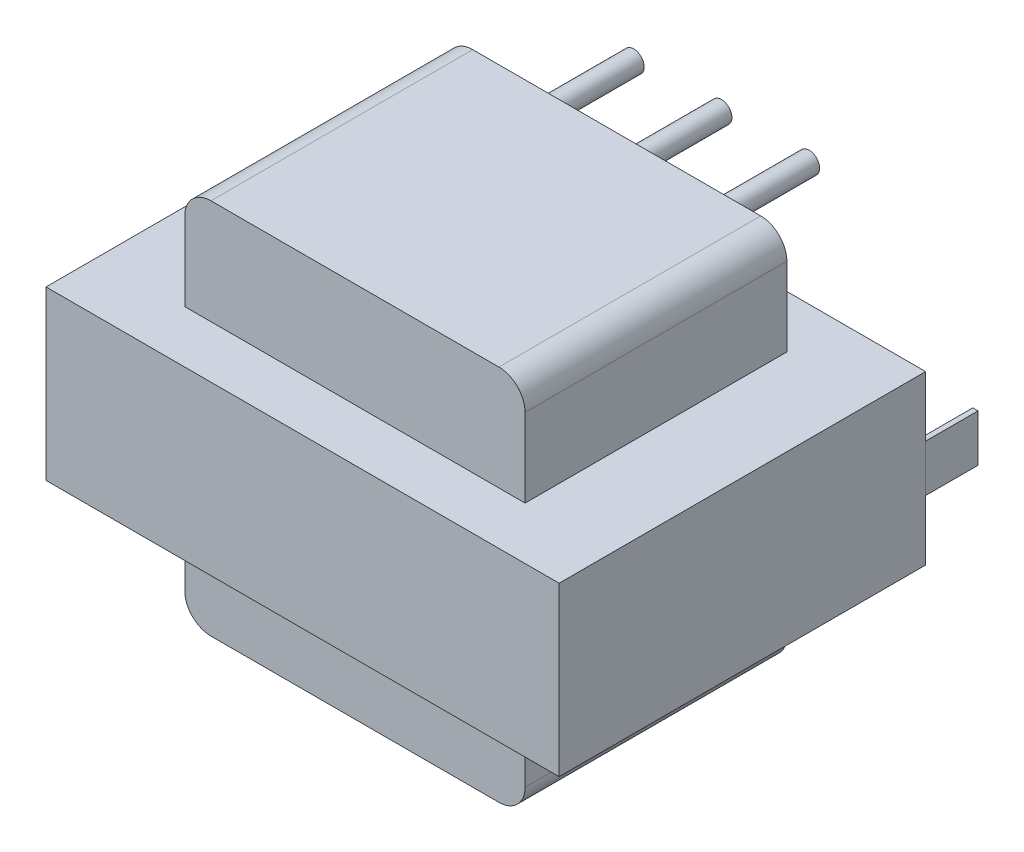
ISO-10303-21;
HEADER;
FILE_DESCRIPTION(('STEP AP214'),'2;1');
FILE_NAME('part.step','',(''),(''),'','','');
FILE_SCHEMA(('AUTOMOTIVE_DESIGN { 1 0 10303 214 1 1 1 1 }'));
ENDSEC;
DATA;
#1=APPLICATION_CONTEXT('core data for automotive mechanical design processes');
#2=APPLICATION_PROTOCOL_DEFINITION('international standard','automotive_design',2000,#1);
#3=PRODUCT_CONTEXT('',#1,'mechanical');
#4=PRODUCT('Part','Part','',(#3));
#5=PRODUCT_RELATED_PRODUCT_CATEGORY('part','',(#4));
#6=PRODUCT_DEFINITION_FORMATION('','',#4);
#7=PRODUCT_DEFINITION_CONTEXT('part definition',#1,'design');
#8=PRODUCT_DEFINITION('design','',#6,#7);
#9=PRODUCT_DEFINITION_SHAPE('','',#8);
#10=(LENGTH_UNIT() NAMED_UNIT(*) SI_UNIT(.MILLI.,.METRE.));
#11=(NAMED_UNIT(*) PLANE_ANGLE_UNIT() SI_UNIT($,.RADIAN.));
#12=(NAMED_UNIT(*) SI_UNIT($,.STERADIAN.) SOLID_ANGLE_UNIT());
#13=UNCERTAINTY_MEASURE_WITH_UNIT(LENGTH_MEASURE(1.E-05),#10,'distance_accuracy_value','');
#14=(GEOMETRIC_REPRESENTATION_CONTEXT(3) GLOBAL_UNCERTAINTY_ASSIGNED_CONTEXT((#13)) GLOBAL_UNIT_ASSIGNED_CONTEXT((#10,
#11,#12)) REPRESENTATION_CONTEXT('',''));
#15=CARTESIAN_POINT('',(0.,0.,0.));
#16=DIRECTION('',(0.,0.,1.));
#17=DIRECTION('',(1.,0.,0.));
#18=AXIS2_PLACEMENT_3D('',#15,#16,#17);
#19=CARTESIAN_POINT('',(12.446,-1.143,-5.08));
#20=DIRECTION('',(-1.,0.,0.));
#21=DIRECTION('',(0.,0.,1.));
#22=AXIS2_PLACEMENT_3D('',#19,#20,#21);
#23=PLANE('',#22);
#24=DIRECTION('',(0.,-1.,0.));
#25=VECTOR('',#24,1.);
#26=CARTESIAN_POINT('',(12.446,-1.143,-2.54));
#27=LINE('',#26,#25);
#28=CARTESIAN_POINT('',(12.446,1.143,-2.54));
#29=VERTEX_POINT('',#28);
#30=CARTESIAN_POINT('',(12.446,-1.143,-2.54));
#31=VERTEX_POINT('',#30);
#32=EDGE_CURVE('E107',#29,#31,#27,.T.);
#33=ORIENTED_EDGE('',*,*,#32,.T.);
#34=DIRECTION('',(0.,0.,1.));
#35=VECTOR('',#34,1.);
#36=CARTESIAN_POINT('',(12.446,-1.143,-5.08));
#37=LINE('',#36,#35);
#38=CARTESIAN_POINT('',(12.446,-1.143,-5.08));
#39=VERTEX_POINT('',#38);
#40=EDGE_CURVE('E12',#39,#31,#37,.T.);
#41=ORIENTED_EDGE('',*,*,#40,.F.);
#42=DIRECTION('',(0.,-1.,0.));
#43=VECTOR('',#42,1.);
#44=CARTESIAN_POINT('',(12.446,-1.143,-5.08));
#45=LINE('',#44,#43);
#46=CARTESIAN_POINT('',(12.446,1.143,-5.08));
#47=VERTEX_POINT('',#46);
#48=EDGE_CURVE('E95',#47,#39,#45,.T.);
#49=ORIENTED_EDGE('',*,*,#48,.F.);
#50=DIRECTION('',(0.,0.,1.));
#51=VECTOR('',#50,1.);
#52=CARTESIAN_POINT('',(12.446,1.143,-5.08));
#53=LINE('',#52,#51);
#54=EDGE_CURVE('E103',#47,#29,#53,.T.);
#55=ORIENTED_EDGE('',*,*,#54,.T.);
#56=EDGE_LOOP('',(#33,#41,#49,#55));
#57=FACE_BOUND('',#56,.T.);
#58=ADVANCED_FACE('F44',(#57),#23,.F.);
#59=CARTESIAN_POINT('',(12.446,-1.143,-5.08));
#60=DIRECTION('',(0.,1.,0.));
#61=DIRECTION('',(0.,0.,1.));
#62=AXIS2_PLACEMENT_3D('',#59,#60,#61);
#63=PLANE('',#62);
#64=DIRECTION('',(-1.,0.,0.));
#65=VECTOR('',#64,1.);
#66=CARTESIAN_POINT('',(12.446,-1.143,-2.54));
#67=LINE('',#66,#65);
#68=CARTESIAN_POINT('',(12.192,-1.143,-2.54));
#69=VERTEX_POINT('',#68);
#70=EDGE_CURVE('E99',#31,#69,#67,.T.);
#71=ORIENTED_EDGE('',*,*,#70,.T.);
#72=DIRECTION('',(0.,0.,1.));
#73=VECTOR('',#72,1.);
#74=CARTESIAN_POINT('',(12.192,-1.143,-5.08));
#75=LINE('',#74,#73);
#76=CARTESIAN_POINT('',(12.192,-1.143,-5.08));
#77=VERTEX_POINT('',#76);
#78=EDGE_CURVE('E52',#77,#69,#75,.T.);
#79=ORIENTED_EDGE('',*,*,#78,.F.);
#80=DIRECTION('',(-1.,0.,0.));
#81=VECTOR('',#80,1.);
#82=CARTESIAN_POINT('',(12.446,-1.143,-5.08));
#83=LINE('',#82,#81);
#84=EDGE_CURVE('E90',#39,#77,#83,.T.);
#85=ORIENTED_EDGE('',*,*,#84,.F.);
#86=ORIENTED_EDGE('',*,*,#40,.T.);
#87=EDGE_LOOP('',(#71,#79,#85,#86));
#88=FACE_BOUND('',#87,.T.);
#89=ADVANCED_FACE('F98',(#88),#63,.F.);
#90=CARTESIAN_POINT('',(12.192,-1.143,-5.08));
#91=DIRECTION('',(1.,0.,0.));
#92=DIRECTION('',(0.,0.,-1.));
#93=AXIS2_PLACEMENT_3D('',#90,#91,#92);
#94=PLANE('',#93);
#95=DIRECTION('',(0.,1.,0.));
#96=VECTOR('',#95,1.);
#97=CARTESIAN_POINT('',(12.192,-1.143,-2.54));
#98=LINE('',#97,#96);
#99=CARTESIAN_POINT('',(12.192,1.143,-2.54));
#100=VERTEX_POINT('',#99);
#101=EDGE_CURVE('E77',#69,#100,#98,.T.);
#102=ORIENTED_EDGE('',*,*,#101,.T.);
#103=DIRECTION('',(0.,0.,1.));
#104=VECTOR('',#103,1.);
#105=CARTESIAN_POINT('',(12.192,1.143,-5.08));
#106=LINE('',#105,#104);
#107=CARTESIAN_POINT('',(12.192,1.143,-5.08));
#108=VERTEX_POINT('',#107);
#109=EDGE_CURVE('E100',#108,#100,#106,.T.);
#110=ORIENTED_EDGE('',*,*,#109,.F.);
#111=DIRECTION('',(0.,1.,0.));
#112=VECTOR('',#111,1.);
#113=CARTESIAN_POINT('',(12.192,-1.143,-5.08));
#114=LINE('',#113,#112);
#115=EDGE_CURVE('E93',#77,#108,#114,.T.);
#116=ORIENTED_EDGE('',*,*,#115,.F.);
#117=ORIENTED_EDGE('',*,*,#78,.T.);
#118=EDGE_LOOP('',(#102,#110,#116,#117));
#119=FACE_BOUND('',#118,.T.);
#120=ADVANCED_FACE('F101',(#119),#94,.F.);
#121=CARTESIAN_POINT('',(12.446,1.143,-5.08));
#122=DIRECTION('',(0.,-1.,0.));
#123=DIRECTION('',(0.,0.,-1.));
#124=AXIS2_PLACEMENT_3D('',#121,#122,#123);
#125=PLANE('',#124);
#126=DIRECTION('',(1.,0.,0.));
#127=VECTOR('',#126,1.);
#128=CARTESIAN_POINT('',(12.446,1.143,-2.54));
#129=LINE('',#128,#127);
#130=EDGE_CURVE('E83',#100,#29,#129,.T.);
#131=ORIENTED_EDGE('',*,*,#130,.T.);
#132=ORIENTED_EDGE('',*,*,#54,.F.);
#133=DIRECTION('',(1.,0.,0.));
#134=VECTOR('',#133,1.);
#135=CARTESIAN_POINT('',(12.446,1.143,-5.08));
#136=LINE('',#135,#134);
#137=EDGE_CURVE('E60',#108,#47,#136,.T.);
#138=ORIENTED_EDGE('',*,*,#137,.F.);
#139=ORIENTED_EDGE('',*,*,#109,.T.);
#140=EDGE_LOOP('',(#131,#132,#138,#139));
#141=FACE_BOUND('',#140,.T.);
#142=ADVANCED_FACE('F114',(#141),#125,.F.);
#143=CARTESIAN_POINT('',(12.446,1.143,-5.08));
#144=DIRECTION('',(0.,0.,1.));
#145=DIRECTION('',(1.,0.,0.));
#146=AXIS2_PLACEMENT_3D('',#143,#144,#145);
#147=PLANE('',#146);
#148=ORIENTED_EDGE('',*,*,#48,.T.);
#149=ORIENTED_EDGE('',*,*,#84,.T.);
#150=ORIENTED_EDGE('',*,*,#115,.T.);
#151=ORIENTED_EDGE('',*,*,#137,.T.);
#152=EDGE_LOOP('',(#148,#149,#150,#151));
#153=FACE_BOUND('',#152,.T.);
#154=ADVANCED_FACE('F91',(#153),#147,.F.);
#155=CARTESIAN_POINT('',(12.446,1.143,-2.54));
#156=DIRECTION('',(0.,0.,1.));
#157=DIRECTION('',(1.,0.,0.));
#158=AXIS2_PLACEMENT_3D('',#155,#156,#157);
#159=PLANE('',#158);
#160=ORIENTED_EDGE('',*,*,#32,.F.);
#161=ORIENTED_EDGE('',*,*,#130,.F.);
#162=ORIENTED_EDGE('',*,*,#101,.F.);
#163=ORIENTED_EDGE('',*,*,#70,.F.);
#164=EDGE_LOOP('',(#160,#161,#162,#163));
#165=FACE_BOUND('',#164,.T.);
#166=ADVANCED_FACE('F117',(#165),#159,.T.);
#167=CLOSED_SHELL('',(#58,#89,#120,#142,#154,#166));
#168=MANIFOLD_SOLID_BREP('B2',#167);
#169=CARTESIAN_POINT('',(-12.446,-1.143,-5.08));
#170=DIRECTION('',(1.,0.,0.));
#171=DIRECTION('',(0.,0.,-1.));
#172=AXIS2_PLACEMENT_3D('',#169,#170,#171);
#173=PLANE('',#172);
#174=DIRECTION('',(0.,1.,0.));
#175=VECTOR('',#174,1.);
#176=CARTESIAN_POINT('',(-12.446,-1.143,-2.54));
#177=LINE('',#176,#175);
#178=CARTESIAN_POINT('',(-12.446,-1.143,-2.54));
#179=VERTEX_POINT('',#178);
#180=CARTESIAN_POINT('',(-12.446,1.143,-2.54));
#181=VERTEX_POINT('',#180);
#182=EDGE_CURVE('E241',#179,#181,#177,.T.);
#183=ORIENTED_EDGE('',*,*,#182,.T.);
#184=DIRECTION('',(0.,0.,1.));
#185=VECTOR('',#184,1.);
#186=CARTESIAN_POINT('',(-12.446,1.143,-5.08));
#187=LINE('',#186,#185);
#188=CARTESIAN_POINT('',(-12.446,1.143,-5.08));
#189=VERTEX_POINT('',#188);
#190=EDGE_CURVE('E42',#189,#181,#187,.T.);
#191=ORIENTED_EDGE('',*,*,#190,.F.);
#192=DIRECTION('',(0.,1.,0.));
#193=VECTOR('',#192,1.);
#194=CARTESIAN_POINT('',(-12.446,-1.143,-5.08));
#195=LINE('',#194,#193);
#196=CARTESIAN_POINT('',(-12.446,-1.143,-5.08));
#197=VERTEX_POINT('',#196);
#198=EDGE_CURVE('E229',#197,#189,#195,.T.);
#199=ORIENTED_EDGE('',*,*,#198,.F.);
#200=DIRECTION('',(0.,0.,1.));
#201=VECTOR('',#200,1.);
#202=CARTESIAN_POINT('',(-12.446,-1.143,-5.08));
#203=LINE('',#202,#201);
#204=EDGE_CURVE('E237',#197,#179,#203,.T.);
#205=ORIENTED_EDGE('',*,*,#204,.T.);
#206=EDGE_LOOP('',(#183,#191,#199,#205));
#207=FACE_BOUND('',#206,.T.);
#208=ADVANCED_FACE('F178',(#207),#173,.F.);
#209=CARTESIAN_POINT('',(-12.446,1.143,-5.08));
#210=DIRECTION('',(0.,-1.,0.));
#211=DIRECTION('',(0.,0.,-1.));
#212=AXIS2_PLACEMENT_3D('',#209,#210,#211);
#213=PLANE('',#212);
#214=DIRECTION('',(1.,0.,0.));
#215=VECTOR('',#214,1.);
#216=CARTESIAN_POINT('',(-12.446,1.143,-2.54));
#217=LINE('',#216,#215);
#218=CARTESIAN_POINT('',(-12.192,1.143,-2.54));
#219=VERTEX_POINT('',#218);
#220=EDGE_CURVE('E233',#181,#219,#217,.T.);
#221=ORIENTED_EDGE('',*,*,#220,.T.);
#222=DIRECTION('',(0.,0.,1.));
#223=VECTOR('',#222,1.);
#224=CARTESIAN_POINT('',(-12.192,1.143,-5.08));
#225=LINE('',#224,#223);
#226=CARTESIAN_POINT('',(-12.192,1.143,-5.08));
#227=VERTEX_POINT('',#226);
#228=EDGE_CURVE('E186',#227,#219,#225,.T.);
#229=ORIENTED_EDGE('',*,*,#228,.F.);
#230=DIRECTION('',(1.,0.,0.));
#231=VECTOR('',#230,1.);
#232=CARTESIAN_POINT('',(-12.446,1.143,-5.08));
#233=LINE('',#232,#231);
#234=EDGE_CURVE('E224',#189,#227,#233,.T.);
#235=ORIENTED_EDGE('',*,*,#234,.F.);
#236=ORIENTED_EDGE('',*,*,#190,.T.);
#237=EDGE_LOOP('',(#221,#229,#235,#236));
#238=FACE_BOUND('',#237,.T.);
#239=ADVANCED_FACE('F232',(#238),#213,.F.);
#240=CARTESIAN_POINT('',(-12.192,-1.143,-5.08));
#241=DIRECTION('',(-1.,0.,0.));
#242=DIRECTION('',(0.,0.,1.));
#243=AXIS2_PLACEMENT_3D('',#240,#241,#242);
#244=PLANE('',#243);
#245=DIRECTION('',(0.,-1.,0.));
#246=VECTOR('',#245,1.);
#247=CARTESIAN_POINT('',(-12.192,-1.143,-2.54));
#248=LINE('',#247,#246);
#249=CARTESIAN_POINT('',(-12.192,-1.143,-2.54));
#250=VERTEX_POINT('',#249);
#251=EDGE_CURVE('E211',#219,#250,#248,.T.);
#252=ORIENTED_EDGE('',*,*,#251,.T.);
#253=DIRECTION('',(0.,0.,1.));
#254=VECTOR('',#253,1.);
#255=CARTESIAN_POINT('',(-12.192,-1.143,-5.08));
#256=LINE('',#255,#254);
#257=CARTESIAN_POINT('',(-12.192,-1.143,-5.08));
#258=VERTEX_POINT('',#257);
#259=EDGE_CURVE('E234',#258,#250,#256,.T.);
#260=ORIENTED_EDGE('',*,*,#259,.F.);
#261=DIRECTION('',(0.,-1.,0.));
#262=VECTOR('',#261,1.);
#263=CARTESIAN_POINT('',(-12.192,-1.143,-5.08));
#264=LINE('',#263,#262);
#265=EDGE_CURVE('E227',#227,#258,#264,.T.);
#266=ORIENTED_EDGE('',*,*,#265,.F.);
#267=ORIENTED_EDGE('',*,*,#228,.T.);
#268=EDGE_LOOP('',(#252,#260,#266,#267));
#269=FACE_BOUND('',#268,.T.);
#270=ADVANCED_FACE('F235',(#269),#244,.F.);
#271=CARTESIAN_POINT('',(-12.446,-1.143,-5.08));
#272=DIRECTION('',(0.,1.,0.));
#273=DIRECTION('',(0.,0.,1.));
#274=AXIS2_PLACEMENT_3D('',#271,#272,#273);
#275=PLANE('',#274);
#276=DIRECTION('',(-1.,0.,0.));
#277=VECTOR('',#276,1.);
#278=CARTESIAN_POINT('',(-12.446,-1.143,-2.54));
#279=LINE('',#278,#277);
#280=EDGE_CURVE('E217',#250,#179,#279,.T.);
#281=ORIENTED_EDGE('',*,*,#280,.T.);
#282=ORIENTED_EDGE('',*,*,#204,.F.);
#283=DIRECTION('',(-1.,0.,0.));
#284=VECTOR('',#283,1.);
#285=CARTESIAN_POINT('',(-12.446,-1.143,-5.08));
#286=LINE('',#285,#284);
#287=EDGE_CURVE('E194',#258,#197,#286,.T.);
#288=ORIENTED_EDGE('',*,*,#287,.F.);
#289=ORIENTED_EDGE('',*,*,#259,.T.);
#290=EDGE_LOOP('',(#281,#282,#288,#289));
#291=FACE_BOUND('',#290,.T.);
#292=ADVANCED_FACE('F248',(#291),#275,.F.);
#293=CARTESIAN_POINT('',(-12.446,1.143,-5.08));
#294=DIRECTION('',(0.,0.,-1.));
#295=DIRECTION('',(-1.,0.,0.));
#296=AXIS2_PLACEMENT_3D('',#293,#294,#295);
#297=PLANE('',#296);
#298=ORIENTED_EDGE('',*,*,#198,.T.);
#299=ORIENTED_EDGE('',*,*,#234,.T.);
#300=ORIENTED_EDGE('',*,*,#265,.T.);
#301=ORIENTED_EDGE('',*,*,#287,.T.);
#302=EDGE_LOOP('',(#298,#299,#300,#301));
#303=FACE_BOUND('',#302,.T.);
#304=ADVANCED_FACE('F225',(#303),#297,.T.);
#305=CARTESIAN_POINT('',(-12.446,1.143,-2.54));
#306=DIRECTION('',(0.,0.,-1.));
#307=DIRECTION('',(-1.,0.,0.));
#308=AXIS2_PLACEMENT_3D('',#305,#306,#307);
#309=PLANE('',#308);
#310=ORIENTED_EDGE('',*,*,#182,.F.);
#311=ORIENTED_EDGE('',*,*,#280,.F.);
#312=ORIENTED_EDGE('',*,*,#251,.F.);
#313=ORIENTED_EDGE('',*,*,#220,.F.);
#314=EDGE_LOOP('',(#310,#311,#312,#313));
#315=FACE_BOUND('',#314,.T.);
#316=ADVANCED_FACE('F251',(#315),#309,.F.);
#317=CLOSED_SHELL('',(#208,#239,#270,#292,#304,#316));
#318=MANIFOLD_SOLID_BREP('B6',#317);
#319=CARTESIAN_POINT('',(-12.446,-4.064,15.24));
#320=DIRECTION('',(-1.,0.,0.));
#321=DIRECTION('',(0.,0.,1.));
#322=AXIS2_PLACEMENT_3D('',#319,#320,#321);
#323=PLANE('',#322);
#324=DIRECTION('',(0.,0.,-1.));
#325=VECTOR('',#324,1.);
#326=CARTESIAN_POINT('',(-12.446,4.064,15.24));
#327=LINE('',#326,#325);
#328=CARTESIAN_POINT('',(-12.446,4.064,15.24));
#329=VERTEX_POINT('',#328);
#330=CARTESIAN_POINT('',(-12.446,4.064,-2.54));
#331=VERTEX_POINT('',#330);
#332=EDGE_CURVE('E313',#329,#331,#327,.T.);
#333=ORIENTED_EDGE('',*,*,#332,.T.);
#334=DIRECTION('',(0.,1.,0.));
#335=VECTOR('',#334,1.);
#336=CARTESIAN_POINT('',(-12.446,-4.064,-2.54));
#337=LINE('',#336,#335);
#338=CARTESIAN_POINT('',(-12.446,-4.064,-2.54));
#339=VERTEX_POINT('',#338);
#340=EDGE_CURVE('E350',#339,#331,#337,.T.);
#341=ORIENTED_EDGE('',*,*,#340,.F.);
#342=DIRECTION('',(0.,0.,-1.));
#343=VECTOR('',#342,1.);
#344=CARTESIAN_POINT('',(-12.446,-4.064,15.24));
#345=LINE('',#344,#343);
#346=CARTESIAN_POINT('',(-12.446,-4.064,15.24));
#347=VERTEX_POINT('',#346);
#348=EDGE_CURVE('E176',#347,#339,#345,.T.);
#349=ORIENTED_EDGE('',*,*,#348,.F.);
#350=DIRECTION('',(0.,1.,0.));
#351=VECTOR('',#350,1.);
#352=CARTESIAN_POINT('',(-12.446,-4.064,15.24));
#353=LINE('',#352,#351);
#354=EDGE_CURVE('E351',#347,#329,#353,.T.);
#355=ORIENTED_EDGE('',*,*,#354,.T.);
#356=EDGE_LOOP('',(#333,#341,#349,#355));
#357=FACE_BOUND('',#356,.T.);
#358=ADVANCED_FACE('F310',(#357),#323,.T.);
#359=CARTESIAN_POINT('',(-12.446,-4.064,15.24));
#360=DIRECTION('',(0.,-1.,0.));
#361=DIRECTION('',(0.,0.,-1.));
#362=AXIS2_PLACEMENT_3D('',#359,#360,#361);
#363=PLANE('',#362);
#364=ORIENTED_EDGE('',*,*,#348,.T.);
#365=DIRECTION('',(-1.,0.,0.));
#366=VECTOR('',#365,1.);
#367=CARTESIAN_POINT('',(-12.446,-4.064,-2.54));
#368=LINE('',#367,#366);
#369=CARTESIAN_POINT('',(12.446,-4.064,-2.54));
#370=VERTEX_POINT('',#369);
#371=EDGE_CURVE('E367',#370,#339,#368,.T.);
#372=ORIENTED_EDGE('',*,*,#371,.F.);
#373=DIRECTION('',(0.,0.,-1.));
#374=VECTOR('',#373,1.);
#375=CARTESIAN_POINT('',(12.446,-4.064,15.24));
#376=LINE('',#375,#374);
#377=CARTESIAN_POINT('',(12.446,-4.064,15.24));
#378=VERTEX_POINT('',#377);
#379=EDGE_CURVE('E318',#378,#370,#376,.T.);
#380=ORIENTED_EDGE('',*,*,#379,.F.);
#381=DIRECTION('',(-1.,0.,0.));
#382=VECTOR('',#381,1.);
#383=CARTESIAN_POINT('',(-12.446,-4.064,15.24));
#384=LINE('',#383,#382);
#385=EDGE_CURVE('E356',#378,#347,#384,.T.);
#386=ORIENTED_EDGE('',*,*,#385,.T.);
#387=EDGE_LOOP('',(#364,#372,#380,#386));
#388=FACE_BOUND('',#387,.T.);
#389=ADVANCED_FACE('F382',(#388),#363,.T.);
#390=CARTESIAN_POINT('',(12.446,-4.064,15.24));
#391=DIRECTION('',(1.,0.,0.));
#392=DIRECTION('',(0.,0.,-1.));
#393=AXIS2_PLACEMENT_3D('',#390,#391,#392);
#394=PLANE('',#393);
#395=ORIENTED_EDGE('',*,*,#379,.T.);
#396=DIRECTION('',(0.,-1.,0.));
#397=VECTOR('',#396,1.);
#398=CARTESIAN_POINT('',(12.446,-4.064,-2.54));
#399=LINE('',#398,#397);
#400=CARTESIAN_POINT('',(12.446,4.064,-2.54));
#401=VERTEX_POINT('',#400);
#402=EDGE_CURVE('E363',#401,#370,#399,.T.);
#403=ORIENTED_EDGE('',*,*,#402,.F.);
#404=DIRECTION('',(0.,0.,-1.));
#405=VECTOR('',#404,1.);
#406=CARTESIAN_POINT('',(12.446,4.064,15.24));
#407=LINE('',#406,#405);
#408=CARTESIAN_POINT('',(12.446,4.064,15.24));
#409=VERTEX_POINT('',#408);
#410=EDGE_CURVE('E355',#409,#401,#407,.T.);
#411=ORIENTED_EDGE('',*,*,#410,.F.);
#412=DIRECTION('',(0.,-1.,0.));
#413=VECTOR('',#412,1.);
#414=CARTESIAN_POINT('',(12.446,-4.064,15.24));
#415=LINE('',#414,#413);
#416=EDGE_CURVE('E375',#409,#378,#415,.T.);
#417=ORIENTED_EDGE('',*,*,#416,.T.);
#418=EDGE_LOOP('',(#395,#403,#411,#417));
#419=FACE_BOUND('',#418,.T.);
#420=ADVANCED_FACE('F379',(#419),#394,.T.);
#421=CARTESIAN_POINT('',(-12.446,4.064,15.24));
#422=DIRECTION('',(0.,1.,0.));
#423=DIRECTION('',(-1.,0.,0.));
#424=AXIS2_PLACEMENT_3D('',#421,#422,#423);
#425=PLANE('',#424);
#426=ORIENTED_EDGE('',*,*,#410,.T.);
#427=DIRECTION('',(1.,0.,0.));
#428=VECTOR('',#427,1.);
#429=CARTESIAN_POINT('',(-12.446,4.064,-2.54));
#430=LINE('',#429,#428);
#431=EDGE_CURVE('E358',#331,#401,#430,.T.);
#432=ORIENTED_EDGE('',*,*,#431,.F.);
#433=ORIENTED_EDGE('',*,*,#332,.F.);
#434=DIRECTION('',(1.,0.,0.));
#435=VECTOR('',#434,1.);
#436=CARTESIAN_POINT('',(-12.446,4.064,15.24));
#437=LINE('',#436,#435);
#438=EDGE_CURVE('E373',#329,#409,#437,.T.);
#439=ORIENTED_EDGE('',*,*,#438,.T.);
#440=EDGE_LOOP('',(#426,#432,#433,#439));
#441=FACE_BOUND('',#440,.T.);
#442=ADVANCED_FACE('F359',(#441),#425,.T.);
#443=CARTESIAN_POINT('',(-12.446,4.064,15.24));
#444=DIRECTION('',(0.,0.,-1.));
#445=DIRECTION('',(-1.,0.,0.));
#446=AXIS2_PLACEMENT_3D('',#443,#444,#445);
#447=PLANE('',#446);
#448=ORIENTED_EDGE('',*,*,#354,.F.);
#449=ORIENTED_EDGE('',*,*,#385,.F.);
#450=ORIENTED_EDGE('',*,*,#416,.F.);
#451=ORIENTED_EDGE('',*,*,#438,.F.);
#452=EDGE_LOOP('',(#448,#449,#450,#451));
#453=FACE_BOUND('',#452,.T.);
#454=ADVANCED_FACE('F384',(#453),#447,.F.);
#455=CARTESIAN_POINT('',(-12.446,4.064,-2.54));
#456=DIRECTION('',(0.,0.,-1.));
#457=DIRECTION('',(-1.,0.,0.));
#458=AXIS2_PLACEMENT_3D('',#455,#456,#457);
#459=PLANE('',#458);
#460=ORIENTED_EDGE('',*,*,#340,.T.);
#461=ORIENTED_EDGE('',*,*,#431,.T.);
#462=ORIENTED_EDGE('',*,*,#402,.T.);
#463=ORIENTED_EDGE('',*,*,#371,.T.);
#464=EDGE_LOOP('',(#460,#461,#462,#463));
#465=FACE_BOUND('',#464,.T.);
#466=ADVANCED_FACE('F366',(#465),#459,.T.);
#467=CLOSED_SHELL('',(#358,#389,#420,#442,#454,#466));
#468=MANIFOLD_SOLID_BREP('B36',#467);
#469=CARTESIAN_POINT('',(-6.985,7.874,0.));
#470=DIRECTION('',(0.,0.,-1.));
#471=DIRECTION('',(-1.,0.,0.));
#472=AXIS2_PLACEMENT_3D('',#469,#470,#471);
#473=PLANE('',#472);
#474=CARTESIAN_POINT('',(0.,-7.493,0.));
#475=DIRECTION('',(0.,0.,-1.));
#476=DIRECTION('',(-1.,0.,0.));
#477=AXIS2_PLACEMENT_3D('',#474,#475,#476);
#478=CIRCLE('',#477,0.508);
#479=CARTESIAN_POINT('',(-0.508,-7.493,0.));
#480=VERTEX_POINT('',#479);
#481=EDGE_CURVE('E602',#480,#480,#478,.T.);
#482=ORIENTED_EDGE('',*,*,#481,.F.);
#483=EDGE_LOOP('',(#482));
#484=FACE_BOUND('',#483,.T.);
#485=CARTESIAN_POINT('',(4.2545,7.493,0.));
#486=DIRECTION('',(0.,0.,-1.));
#487=DIRECTION('',(-1.,0.,0.));
#488=AXIS2_PLACEMENT_3D('',#485,#486,#487);
#489=CIRCLE('',#488,0.508);
#490=CARTESIAN_POINT('',(3.7465,7.493,0.));
#491=VERTEX_POINT('',#490);
#492=EDGE_CURVE('E590',#491,#491,#489,.T.);
#493=ORIENTED_EDGE('',*,*,#492,.F.);
#494=EDGE_LOOP('',(#493));
#495=FACE_BOUND('',#494,.T.);
#496=CARTESIAN_POINT('',(-4.2545,7.493,0.));
#497=DIRECTION('',(0.,0.,-1.));
#498=DIRECTION('',(-1.,0.,0.));
#499=AXIS2_PLACEMENT_3D('',#496,#497,#498);
#500=CIRCLE('',#499,0.508);
#501=CARTESIAN_POINT('',(-4.7625,7.493,0.));
#502=VERTEX_POINT('',#501);
#503=EDGE_CURVE('E578',#502,#502,#500,.T.);
#504=ORIENTED_EDGE('',*,*,#503,.F.);
#505=EDGE_LOOP('',(#504));
#506=FACE_BOUND('',#505,.T.);
#507=CARTESIAN_POINT('',(-6.985,7.874,0.));
#508=DIRECTION('',(0.,0.,1.));
#509=DIRECTION('',(-1.,0.,0.));
#510=AXIS2_PLACEMENT_3D('',#507,#508,#509);
#511=CIRCLE('',#510,1.27);
#512=CARTESIAN_POINT('',(-6.985,9.144,0.));
#513=VERTEX_POINT('',#512);
#514=CARTESIAN_POINT('',(-8.255,7.874,0.));
#515=VERTEX_POINT('',#514);
#516=EDGE_CURVE('E530',#513,#515,#511,.T.);
#517=ORIENTED_EDGE('',*,*,#516,.F.);
#518=DIRECTION('',(-1.,0.,0.));
#519=VECTOR('',#518,1.);
#520=CARTESIAN_POINT('',(-6.985,9.144,0.));
#521=LINE('',#520,#519);
#522=CARTESIAN_POINT('',(6.985,9.144,0.));
#523=VERTEX_POINT('',#522);
#524=EDGE_CURVE('E485',#523,#513,#521,.T.);
#525=ORIENTED_EDGE('',*,*,#524,.F.);
#526=CARTESIAN_POINT('',(6.985,7.874,0.));
#527=DIRECTION('',(0.,0.,1.));
#528=DIRECTION('',(1.,0.,0.));
#529=AXIS2_PLACEMENT_3D('',#526,#527,#528);
#530=CIRCLE('',#529,1.27);
#531=CARTESIAN_POINT('',(8.255,7.874,0.));
#532=VERTEX_POINT('',#531);
#533=EDGE_CURVE('E479',#532,#523,#530,.T.);
#534=ORIENTED_EDGE('',*,*,#533,.F.);
#535=DIRECTION('',(0.,1.,0.));
#536=VECTOR('',#535,1.);
#537=CARTESIAN_POINT('',(8.255,7.874,0.));
#538=LINE('',#537,#536);
#539=CARTESIAN_POINT('',(8.255,-7.874,0.));
#540=VERTEX_POINT('',#539);
#541=EDGE_CURVE('E520',#540,#532,#538,.T.);
#542=ORIENTED_EDGE('',*,*,#541,.F.);
#543=CARTESIAN_POINT('',(6.985,-7.874,0.));
#544=DIRECTION('',(0.,0.,1.));
#545=DIRECTION('',(1.,0.,0.));
#546=AXIS2_PLACEMENT_3D('',#543,#544,#545);
#547=CIRCLE('',#546,1.27);
#548=CARTESIAN_POINT('',(6.985,-9.144,0.));
#549=VERTEX_POINT('',#548);
#550=EDGE_CURVE('E540',#549,#540,#547,.T.);
#551=ORIENTED_EDGE('',*,*,#550,.F.);
#552=DIRECTION('',(1.,0.,0.));
#553=VECTOR('',#552,1.);
#554=CARTESIAN_POINT('',(-6.985,-9.144,0.));
#555=LINE('',#554,#553);
#556=CARTESIAN_POINT('',(-6.985,-9.144,0.));
#557=VERTEX_POINT('',#556);
#558=EDGE_CURVE('E538',#557,#549,#555,.T.);
#559=ORIENTED_EDGE('',*,*,#558,.F.);
#560=CARTESIAN_POINT('',(-6.985,-7.874,0.));
#561=DIRECTION('',(0.,0.,1.));
#562=DIRECTION('',(-1.,0.,0.));
#563=AXIS2_PLACEMENT_3D('',#560,#561,#562);
#564=CIRCLE('',#563,1.27);
#565=CARTESIAN_POINT('',(-8.255,-7.874,0.));
#566=VERTEX_POINT('',#565);
#567=EDGE_CURVE('E536',#566,#557,#564,.T.);
#568=ORIENTED_EDGE('',*,*,#567,.F.);
#569=DIRECTION('',(0.,-1.,0.));
#570=VECTOR('',#569,1.);
#571=CARTESIAN_POINT('',(-8.255,7.874,0.));
#572=LINE('',#571,#570);
#573=EDGE_CURVE('E533',#515,#566,#572,.T.);
#574=ORIENTED_EDGE('',*,*,#573,.F.);
#575=EDGE_LOOP('',(#517,#525,#534,#542,#551,#559,#568,#574));
#576=FACE_BOUND('',#575,.T.);
#577=CARTESIAN_POINT('',(0.,7.493,0.));
#578=DIRECTION('',(0.,0.,-1.));
#579=DIRECTION('',(-1.,0.,0.));
#580=AXIS2_PLACEMENT_3D('',#577,#578,#579);
#581=CIRCLE('',#580,0.508);
#582=CARTESIAN_POINT('',(-0.508,7.493,0.));
#583=VERTEX_POINT('',#582);
#584=EDGE_CURVE('E584',#583,#583,#581,.T.);
#585=ORIENTED_EDGE('',*,*,#584,.F.);
#586=EDGE_LOOP('',(#585));
#587=FACE_BOUND('',#586,.T.);
#588=CARTESIAN_POINT('',(-4.2545,-7.493,0.));
#589=DIRECTION('',(0.,0.,-1.));
#590=DIRECTION('',(-1.,0.,0.));
#591=AXIS2_PLACEMENT_3D('',#588,#589,#590);
#592=CIRCLE('',#591,0.508);
#593=CARTESIAN_POINT('',(-4.7625,-7.493,0.));
#594=VERTEX_POINT('',#593);
#595=EDGE_CURVE('E596',#594,#594,#592,.T.);
#596=ORIENTED_EDGE('',*,*,#595,.F.);
#597=EDGE_LOOP('',(#596));
#598=FACE_BOUND('',#597,.T.);
#599=CARTESIAN_POINT('',(4.2545,-7.493,0.));
#600=DIRECTION('',(0.,0.,-1.));
#601=DIRECTION('',(-1.,0.,0.));
#602=AXIS2_PLACEMENT_3D('',#599,#600,#601);
#603=CIRCLE('',#602,0.508);
#604=CARTESIAN_POINT('',(3.7465,-7.493,0.));
#605=VERTEX_POINT('',#604);
#606=EDGE_CURVE('E608',#605,#605,#603,.T.);
#607=ORIENTED_EDGE('',*,*,#606,.F.);
#608=EDGE_LOOP('',(#607));
#609=FACE_BOUND('',#608,.T.);
#610=ADVANCED_FACE('F433',(#484,#495,#506,#576,#587,#598,#609),#473,.T.);
#611=CARTESIAN_POINT('',(-6.985,7.874,12.7));
#612=DIRECTION('',(0.,0.,-1.));
#613=DIRECTION('',(-1.,0.,0.));
#614=AXIS2_PLACEMENT_3D('',#611,#612,#613);
#615=CYLINDRICAL_SURFACE('',#614,1.27);
#616=ORIENTED_EDGE('',*,*,#516,.T.);
#617=DIRECTION('',(0.,0.,-1.));
#618=VECTOR('',#617,1.);
#619=CARTESIAN_POINT('',(-8.255,7.874,12.7));
#620=LINE('',#619,#618);
#621=CARTESIAN_POINT('',(-8.255,7.874,12.7));
#622=VERTEX_POINT('',#621);
#623=EDGE_CURVE('E308',#622,#515,#620,.T.);
#624=ORIENTED_EDGE('',*,*,#623,.F.);
#625=CARTESIAN_POINT('',(-6.985,7.874,12.7));
#626=DIRECTION('',(0.,0.,1.));
#627=DIRECTION('',(-1.,0.,0.));
#628=AXIS2_PLACEMENT_3D('',#625,#626,#627);
#629=CIRCLE('',#628,1.27);
#630=CARTESIAN_POINT('',(-6.985,9.144,12.7));
#631=VERTEX_POINT('',#630);
#632=EDGE_CURVE('E545',#631,#622,#629,.T.);
#633=ORIENTED_EDGE('',*,*,#632,.F.);
#634=DIRECTION('',(0.,0.,-1.));
#635=VECTOR('',#634,1.);
#636=CARTESIAN_POINT('',(-6.985,9.144,12.7));
#637=LINE('',#636,#635);
#638=EDGE_CURVE('E526',#631,#513,#637,.T.);
#639=ORIENTED_EDGE('',*,*,#638,.T.);
#640=EDGE_LOOP('',(#616,#624,#633,#639));
#641=FACE_BOUND('',#640,.T.);
#642=ADVANCED_FACE('F435',(#641),#615,.T.);
#643=CARTESIAN_POINT('',(-8.255,7.874,12.7));
#644=DIRECTION('',(1.,0.,0.));
#645=DIRECTION('',(0.,1.,0.));
#646=AXIS2_PLACEMENT_3D('',#643,#644,#645);
#647=PLANE('',#646);
#648=ORIENTED_EDGE('',*,*,#573,.T.);
#649=DIRECTION('',(0.,0.,-1.));
#650=VECTOR('',#649,1.);
#651=CARTESIAN_POINT('',(-8.255,-7.874,12.7));
#652=LINE('',#651,#650);
#653=CARTESIAN_POINT('',(-8.255,-7.874,12.7));
#654=VERTEX_POINT('',#653);
#655=EDGE_CURVE('E442',#654,#566,#652,.T.);
#656=ORIENTED_EDGE('',*,*,#655,.F.);
#657=DIRECTION('',(0.,-1.,0.));
#658=VECTOR('',#657,1.);
#659=CARTESIAN_POINT('',(-8.255,7.874,12.7));
#660=LINE('',#659,#658);
#661=EDGE_CURVE('E493',#622,#654,#660,.T.);
#662=ORIENTED_EDGE('',*,*,#661,.F.);
#663=ORIENTED_EDGE('',*,*,#623,.T.);
#664=EDGE_LOOP('',(#648,#656,#662,#663));
#665=FACE_BOUND('',#664,.T.);
#666=ADVANCED_FACE('F629',(#665),#647,.F.);
#667=CARTESIAN_POINT('',(-6.985,-7.874,12.7));
#668=DIRECTION('',(0.,0.,-1.));
#669=DIRECTION('',(-1.,0.,0.));
#670=AXIS2_PLACEMENT_3D('',#667,#668,#669);
#671=CYLINDRICAL_SURFACE('',#670,1.27);
#672=ORIENTED_EDGE('',*,*,#567,.T.);
#673=DIRECTION('',(0.,0.,-1.));
#674=VECTOR('',#673,1.);
#675=CARTESIAN_POINT('',(-6.985,-9.144,12.7));
#676=LINE('',#675,#674);
#677=CARTESIAN_POINT('',(-6.985,-9.144,12.7));
#678=VERTEX_POINT('',#677);
#679=EDGE_CURVE('E552',#678,#557,#676,.T.);
#680=ORIENTED_EDGE('',*,*,#679,.F.);
#681=CARTESIAN_POINT('',(-6.985,-7.874,12.7));
#682=DIRECTION('',(0.,0.,1.));
#683=DIRECTION('',(-1.,0.,0.));
#684=AXIS2_PLACEMENT_3D('',#681,#682,#683);
#685=CIRCLE('',#684,1.27);
#686=EDGE_CURVE('E560',#654,#678,#685,.T.);
#687=ORIENTED_EDGE('',*,*,#686,.F.);
#688=ORIENTED_EDGE('',*,*,#655,.T.);
#689=EDGE_LOOP('',(#672,#680,#687,#688));
#690=FACE_BOUND('',#689,.T.);
#691=ADVANCED_FACE('F558',(#690),#671,.T.);
#692=CARTESIAN_POINT('',(-6.985,-9.144,12.7));
#693=DIRECTION('',(0.,1.,0.));
#694=DIRECTION('',(0.,0.,1.));
#695=AXIS2_PLACEMENT_3D('',#692,#693,#694);
#696=PLANE('',#695);
#697=ORIENTED_EDGE('',*,*,#558,.T.);
#698=DIRECTION('',(0.,0.,-1.));
#699=VECTOR('',#698,1.);
#700=CARTESIAN_POINT('',(6.985,-9.144,12.7));
#701=LINE('',#700,#699);
#702=CARTESIAN_POINT('',(6.985,-9.144,12.7));
#703=VERTEX_POINT('',#702);
#704=EDGE_CURVE('E549',#703,#549,#701,.T.);
#705=ORIENTED_EDGE('',*,*,#704,.F.);
#706=DIRECTION('',(1.,0.,0.));
#707=VECTOR('',#706,1.);
#708=CARTESIAN_POINT('',(-6.985,-9.144,12.7));
#709=LINE('',#708,#707);
#710=EDGE_CURVE('E572',#678,#703,#709,.T.);
#711=ORIENTED_EDGE('',*,*,#710,.F.);
#712=ORIENTED_EDGE('',*,*,#679,.T.);
#713=EDGE_LOOP('',(#697,#705,#711,#712));
#714=FACE_BOUND('',#713,.T.);
#715=ADVANCED_FACE('F568',(#714),#696,.F.);
#716=CARTESIAN_POINT('',(6.985,-7.874,12.7));
#717=DIRECTION('',(0.,0.,-1.));
#718=DIRECTION('',(-1.,0.,0.));
#719=AXIS2_PLACEMENT_3D('',#716,#717,#718);
#720=CYLINDRICAL_SURFACE('',#719,1.27);
#721=ORIENTED_EDGE('',*,*,#550,.T.);
#722=DIRECTION('',(0.,0.,-1.));
#723=VECTOR('',#722,1.);
#724=CARTESIAN_POINT('',(8.255,-7.874,12.7));
#725=LINE('',#724,#723);
#726=CARTESIAN_POINT('',(8.255,-7.874,12.7));
#727=VERTEX_POINT('',#726);
#728=EDGE_CURVE('E521',#727,#540,#725,.T.);
#729=ORIENTED_EDGE('',*,*,#728,.F.);
#730=CARTESIAN_POINT('',(6.985,-7.874,12.7));
#731=DIRECTION('',(0.,0.,1.));
#732=DIRECTION('',(1.,0.,0.));
#733=AXIS2_PLACEMENT_3D('',#730,#731,#732);
#734=CIRCLE('',#733,1.27);
#735=EDGE_CURVE('E512',#703,#727,#734,.T.);
#736=ORIENTED_EDGE('',*,*,#735,.F.);
#737=ORIENTED_EDGE('',*,*,#704,.T.);
#738=EDGE_LOOP('',(#721,#729,#736,#737));
#739=FACE_BOUND('',#738,.T.);
#740=ADVANCED_FACE('F571',(#739),#720,.T.);
#741=CARTESIAN_POINT('',(8.255,7.874,12.7));
#742=DIRECTION('',(-1.,0.,0.));
#743=DIRECTION('',(0.,-1.,0.));
#744=AXIS2_PLACEMENT_3D('',#741,#742,#743);
#745=PLANE('',#744);
#746=ORIENTED_EDGE('',*,*,#541,.T.);
#747=DIRECTION('',(0.,0.,-1.));
#748=VECTOR('',#747,1.);
#749=CARTESIAN_POINT('',(8.255,7.874,12.7));
#750=LINE('',#749,#748);
#751=CARTESIAN_POINT('',(8.255,7.874,12.7));
#752=VERTEX_POINT('',#751);
#753=EDGE_CURVE('E517',#752,#532,#750,.T.);
#754=ORIENTED_EDGE('',*,*,#753,.F.);
#755=DIRECTION('',(0.,1.,0.));
#756=VECTOR('',#755,1.);
#757=CARTESIAN_POINT('',(8.255,7.874,12.7));
#758=LINE('',#757,#756);
#759=EDGE_CURVE('E506',#727,#752,#758,.T.);
#760=ORIENTED_EDGE('',*,*,#759,.F.);
#761=ORIENTED_EDGE('',*,*,#728,.T.);
#762=EDGE_LOOP('',(#746,#754,#760,#761));
#763=FACE_BOUND('',#762,.T.);
#764=ADVANCED_FACE('F518',(#763),#745,.F.);
#765=CARTESIAN_POINT('',(6.985,7.874,12.7));
#766=DIRECTION('',(0.,0.,-1.));
#767=DIRECTION('',(-1.,0.,0.));
#768=AXIS2_PLACEMENT_3D('',#765,#766,#767);
#769=CYLINDRICAL_SURFACE('',#768,1.27);
#770=ORIENTED_EDGE('',*,*,#533,.T.);
#771=DIRECTION('',(0.,0.,-1.));
#772=VECTOR('',#771,1.);
#773=CARTESIAN_POINT('',(6.985,9.144,12.7));
#774=LINE('',#773,#772);
#775=CARTESIAN_POINT('',(6.985,9.144,12.7));
#776=VERTEX_POINT('',#775);
#777=EDGE_CURVE('E522',#776,#523,#774,.T.);
#778=ORIENTED_EDGE('',*,*,#777,.F.);
#779=CARTESIAN_POINT('',(6.985,7.874,12.7));
#780=DIRECTION('',(0.,0.,1.));
#781=DIRECTION('',(1.,0.,0.));
#782=AXIS2_PLACEMENT_3D('',#779,#780,#781);
#783=CIRCLE('',#782,1.27);
#784=EDGE_CURVE('E510',#752,#776,#783,.T.);
#785=ORIENTED_EDGE('',*,*,#784,.F.);
#786=ORIENTED_EDGE('',*,*,#753,.T.);
#787=EDGE_LOOP('',(#770,#778,#785,#786));
#788=FACE_BOUND('',#787,.T.);
#789=ADVANCED_FACE('F524',(#788),#769,.T.);
#790=CARTESIAN_POINT('',(-6.985,9.144,12.7));
#791=DIRECTION('',(0.,-1.,0.));
#792=DIRECTION('',(0.,0.,-1.));
#793=AXIS2_PLACEMENT_3D('',#790,#791,#792);
#794=PLANE('',#793);
#795=ORIENTED_EDGE('',*,*,#524,.T.);
#796=ORIENTED_EDGE('',*,*,#638,.F.);
#797=DIRECTION('',(-1.,0.,0.));
#798=VECTOR('',#797,1.);
#799=CARTESIAN_POINT('',(-6.985,9.144,12.7));
#800=LINE('',#799,#798);
#801=EDGE_CURVE('E450',#776,#631,#800,.T.);
#802=ORIENTED_EDGE('',*,*,#801,.F.);
#803=ORIENTED_EDGE('',*,*,#777,.T.);
#804=EDGE_LOOP('',(#795,#796,#802,#803));
#805=FACE_BOUND('',#804,.T.);
#806=ADVANCED_FACE('F636',(#805),#794,.F.);
#807=CARTESIAN_POINT('',(-6.985,7.874,12.7));
#808=DIRECTION('',(0.,0.,-1.));
#809=DIRECTION('',(-1.,0.,0.));
#810=AXIS2_PLACEMENT_3D('',#807,#808,#809);
#811=PLANE('',#810);
#812=ORIENTED_EDGE('',*,*,#632,.T.);
#813=ORIENTED_EDGE('',*,*,#661,.T.);
#814=ORIENTED_EDGE('',*,*,#686,.T.);
#815=ORIENTED_EDGE('',*,*,#710,.T.);
#816=ORIENTED_EDGE('',*,*,#735,.T.);
#817=ORIENTED_EDGE('',*,*,#759,.T.);
#818=ORIENTED_EDGE('',*,*,#784,.T.);
#819=ORIENTED_EDGE('',*,*,#801,.T.);
#820=EDGE_LOOP('',(#812,#813,#814,#815,#816,#817,#818,#819));
#821=FACE_BOUND('',#820,.T.);
#822=ADVANCED_FACE('F508',(#821),#811,.F.);
#823=CARTESIAN_POINT('',(-4.2545,7.493,-5.08));
#824=DIRECTION('',(0.,0.,1.));
#825=DIRECTION('',(1.,0.,0.));
#826=AXIS2_PLACEMENT_3D('',#823,#824,#825);
#827=CYLINDRICAL_SURFACE('',#826,0.508);
#828=CARTESIAN_POINT('',(-4.2545,7.493,-5.08));
#829=DIRECTION('',(0.,0.,-1.));
#830=DIRECTION('',(-1.,0.,0.));
#831=AXIS2_PLACEMENT_3D('',#828,#829,#830);
#832=CIRCLE('',#831,0.508);
#833=CARTESIAN_POINT('',(-4.7625,7.493,-5.08));
#834=VERTEX_POINT('',#833);
#835=EDGE_CURVE('E534',#834,#834,#832,.T.);
#836=ORIENTED_EDGE('',*,*,#835,.F.);
#837=EDGE_LOOP('',(#836));
#838=FACE_BOUND('',#837,.T.);
#839=ORIENTED_EDGE('',*,*,#503,.T.);
#840=EDGE_LOOP('',(#839));
#841=FACE_BOUND('',#840,.T.);
#842=ADVANCED_FACE('F685',(#838,#841),#827,.T.);
#843=CARTESIAN_POINT('',(-4.2545,7.493,-5.08));
#844=DIRECTION('',(0.,0.,-1.));
#845=DIRECTION('',(-1.,0.,0.));
#846=AXIS2_PLACEMENT_3D('',#843,#844,#845);
#847=PLANE('',#846);
#848=ORIENTED_EDGE('',*,*,#835,.T.);
#849=EDGE_LOOP('',(#848));
#850=FACE_BOUND('',#849,.T.);
#851=ADVANCED_FACE('F691',(#850),#847,.T.);
#852=CARTESIAN_POINT('',(0.,7.493,-5.08));
#853=DIRECTION('',(0.,0.,1.));
#854=DIRECTION('',(1.,0.,0.));
#855=AXIS2_PLACEMENT_3D('',#852,#853,#854);
#856=CYLINDRICAL_SURFACE('',#855,0.508);
#857=CARTESIAN_POINT('',(0.,7.493,-5.08));
#858=DIRECTION('',(0.,0.,-1.));
#859=DIRECTION('',(-1.,0.,0.));
#860=AXIS2_PLACEMENT_3D('',#857,#858,#859);
#861=CIRCLE('',#860,0.508);
#862=CARTESIAN_POINT('',(-0.508,7.493,-5.08));
#863=VERTEX_POINT('',#862);
#864=EDGE_CURVE('E581',#863,#863,#861,.T.);
#865=ORIENTED_EDGE('',*,*,#864,.F.);
#866=EDGE_LOOP('',(#865));
#867=FACE_BOUND('',#866,.T.);
#868=ORIENTED_EDGE('',*,*,#584,.T.);
#869=EDGE_LOOP('',(#868));
#870=FACE_BOUND('',#869,.T.);
#871=ADVANCED_FACE('F698',(#867,#870),#856,.T.);
#872=CARTESIAN_POINT('',(0.,7.493,-5.08));
#873=DIRECTION('',(0.,0.,-1.));
#874=DIRECTION('',(-1.,0.,0.));
#875=AXIS2_PLACEMENT_3D('',#872,#873,#874);
#876=PLANE('',#875);
#877=ORIENTED_EDGE('',*,*,#864,.T.);
#878=EDGE_LOOP('',(#877));
#879=FACE_BOUND('',#878,.T.);
#880=ADVANCED_FACE('F706',(#879),#876,.T.);
#881=CARTESIAN_POINT('',(4.2545,7.493,-5.08));
#882=DIRECTION('',(0.,0.,1.));
#883=DIRECTION('',(1.,0.,0.));
#884=AXIS2_PLACEMENT_3D('',#881,#882,#883);
#885=CYLINDRICAL_SURFACE('',#884,0.508);
#886=CARTESIAN_POINT('',(4.2545,7.493,-5.08));
#887=DIRECTION('',(0.,0.,-1.));
#888=DIRECTION('',(-1.,0.,0.));
#889=AXIS2_PLACEMENT_3D('',#886,#887,#888);
#890=CIRCLE('',#889,0.508);
#891=CARTESIAN_POINT('',(3.7465,7.493,-5.08));
#892=VERTEX_POINT('',#891);
#893=EDGE_CURVE('E587',#892,#892,#890,.T.);
#894=ORIENTED_EDGE('',*,*,#893,.F.);
#895=EDGE_LOOP('',(#894));
#896=FACE_BOUND('',#895,.T.);
#897=ORIENTED_EDGE('',*,*,#492,.T.);
#898=EDGE_LOOP('',(#897));
#899=FACE_BOUND('',#898,.T.);
#900=ADVANCED_FACE('F714',(#896,#899),#885,.T.);
#901=CARTESIAN_POINT('',(4.2545,7.493,-5.08));
#902=DIRECTION('',(0.,0.,-1.));
#903=DIRECTION('',(-1.,0.,0.));
#904=AXIS2_PLACEMENT_3D('',#901,#902,#903);
#905=PLANE('',#904);
#906=ORIENTED_EDGE('',*,*,#893,.T.);
#907=EDGE_LOOP('',(#906));
#908=FACE_BOUND('',#907,.T.);
#909=ADVANCED_FACE('F722',(#908),#905,.T.);
#910=CARTESIAN_POINT('',(-4.2545,-7.493,-5.08));
#911=DIRECTION('',(0.,0.,1.));
#912=DIRECTION('',(1.,0.,0.));
#913=AXIS2_PLACEMENT_3D('',#910,#911,#912);
#914=CYLINDRICAL_SURFACE('',#913,0.508);
#915=CARTESIAN_POINT('',(-4.2545,-7.493,-5.08));
#916=DIRECTION('',(0.,0.,-1.));
#917=DIRECTION('',(-1.,0.,0.));
#918=AXIS2_PLACEMENT_3D('',#915,#916,#917);
#919=CIRCLE('',#918,0.508);
#920=CARTESIAN_POINT('',(-4.7625,-7.493,-5.08));
#921=VERTEX_POINT('',#920);
#922=EDGE_CURVE('E593',#921,#921,#919,.T.);
#923=ORIENTED_EDGE('',*,*,#922,.F.);
#924=EDGE_LOOP('',(#923));
#925=FACE_BOUND('',#924,.T.);
#926=ORIENTED_EDGE('',*,*,#595,.T.);
#927=EDGE_LOOP('',(#926));
#928=FACE_BOUND('',#927,.T.);
#929=ADVANCED_FACE('F730',(#925,#928),#914,.T.);
#930=CARTESIAN_POINT('',(-4.2545,-7.493,-5.08));
#931=DIRECTION('',(0.,0.,-1.));
#932=DIRECTION('',(-1.,0.,0.));
#933=AXIS2_PLACEMENT_3D('',#930,#931,#932);
#934=PLANE('',#933);
#935=ORIENTED_EDGE('',*,*,#922,.T.);
#936=EDGE_LOOP('',(#935));
#937=FACE_BOUND('',#936,.T.);
#938=ADVANCED_FACE('F738',(#937),#934,.T.);
#939=CARTESIAN_POINT('',(0.,-7.493,-5.08));
#940=DIRECTION('',(0.,0.,1.));
#941=DIRECTION('',(1.,0.,0.));
#942=AXIS2_PLACEMENT_3D('',#939,#940,#941);
#943=CYLINDRICAL_SURFACE('',#942,0.508);
#944=CARTESIAN_POINT('',(0.,-7.493,-5.08));
#945=DIRECTION('',(0.,0.,-1.));
#946=DIRECTION('',(-1.,0.,0.));
#947=AXIS2_PLACEMENT_3D('',#944,#945,#946);
#948=CIRCLE('',#947,0.508);
#949=CARTESIAN_POINT('',(-0.508,-7.493,-5.08));
#950=VERTEX_POINT('',#949);
#951=EDGE_CURVE('E599',#950,#950,#948,.T.);
#952=ORIENTED_EDGE('',*,*,#951,.F.);
#953=EDGE_LOOP('',(#952));
#954=FACE_BOUND('',#953,.T.);
#955=ORIENTED_EDGE('',*,*,#481,.T.);
#956=EDGE_LOOP('',(#955));
#957=FACE_BOUND('',#956,.T.);
#958=ADVANCED_FACE('F746',(#954,#957),#943,.T.);
#959=CARTESIAN_POINT('',(0.,-7.493,-5.08));
#960=DIRECTION('',(0.,0.,-1.));
#961=DIRECTION('',(-1.,0.,0.));
#962=AXIS2_PLACEMENT_3D('',#959,#960,#961);
#963=PLANE('',#962);
#964=ORIENTED_EDGE('',*,*,#951,.T.);
#965=EDGE_LOOP('',(#964));
#966=FACE_BOUND('',#965,.T.);
#967=ADVANCED_FACE('F619',(#966),#963,.T.);
#968=CARTESIAN_POINT('',(4.2545,-7.493,-5.08));
#969=DIRECTION('',(0.,0.,1.));
#970=DIRECTION('',(1.,0.,0.));
#971=AXIS2_PLACEMENT_3D('',#968,#969,#970);
#972=CYLINDRICAL_SURFACE('',#971,0.508);
#973=CARTESIAN_POINT('',(4.2545,-7.493,-5.08));
#974=DIRECTION('',(0.,0.,-1.));
#975=DIRECTION('',(-1.,0.,0.));
#976=AXIS2_PLACEMENT_3D('',#973,#974,#975);
#977=CIRCLE('',#976,0.508);
#978=CARTESIAN_POINT('',(3.7465,-7.493,-5.08));
#979=VERTEX_POINT('',#978);
#980=EDGE_CURVE('E605',#979,#979,#977,.T.);
#981=ORIENTED_EDGE('',*,*,#980,.F.);
#982=EDGE_LOOP('',(#981));
#983=FACE_BOUND('',#982,.T.);
#984=ORIENTED_EDGE('',*,*,#606,.T.);
#985=EDGE_LOOP('',(#984));
#986=FACE_BOUND('',#985,.T.);
#987=ADVANCED_FACE('F616',(#983,#986),#972,.T.);
#988=CARTESIAN_POINT('',(4.2545,-7.493,-5.08));
#989=DIRECTION('',(0.,0.,-1.));
#990=DIRECTION('',(-1.,0.,0.));
#991=AXIS2_PLACEMENT_3D('',#988,#989,#990);
#992=PLANE('',#991);
#993=ORIENTED_EDGE('',*,*,#980,.T.);
#994=EDGE_LOOP('',(#993));
#995=FACE_BOUND('',#994,.T.);
#996=ADVANCED_FACE('F614',(#995),#992,.T.);
#997=CLOSED_SHELL('',(#610,#642,#666,#691,#715,#740,#764,#789,#806,#822,#842,#851,#871,#880,
#900,#909,#929,#938,#958,#967,#987,#996));
#998=MANIFOLD_SOLID_BREP('B170',#997);
#999=ADVANCED_BREP_SHAPE_REPRESENTATION('',(#18,#168,#318,#468,#998),#14);
#1000=SHAPE_DEFINITION_REPRESENTATION(#9,#999);
ENDSEC;
END-ISO-10303-21;
